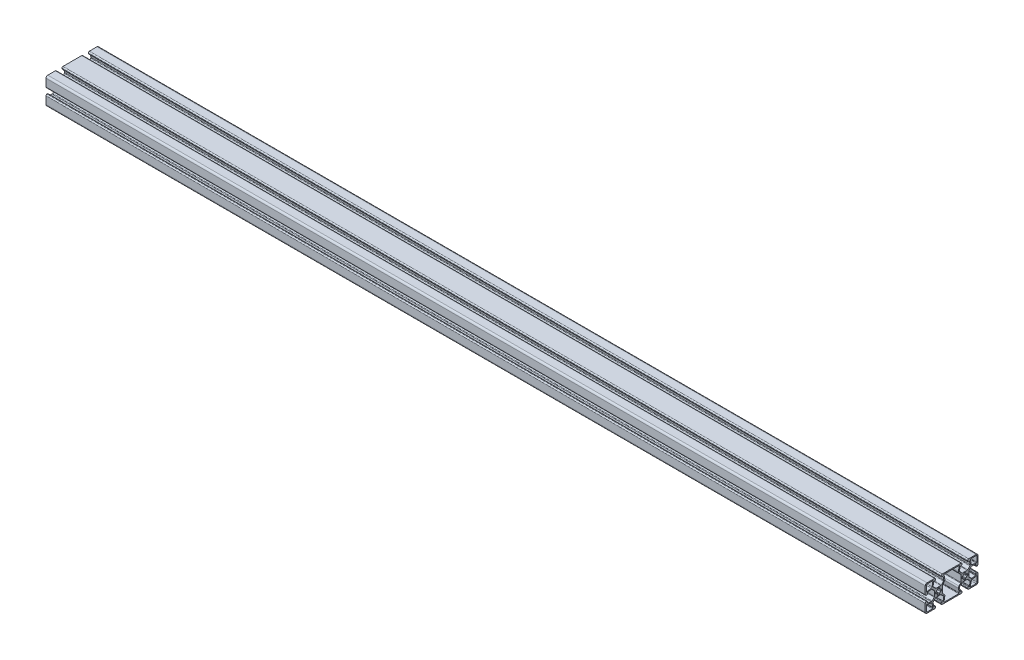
from build123d import *

# Parameters (mm, degrees)
EXTRUDE_1_DEPTH = 1000


with BuildPart() as part:
    # Sketch 1 → Extrude 1 (new body)
    with BuildSketch(Plane(origin=(0, 0, 0), x_dir=(0, 0, -1), z_dir=(1, 0, 0))):
        with BuildLine():
            Line((2.671572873, 4.500000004), (-2.671572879, 4.500000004))
            ThreePointArc((-2.671572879, 4.500000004), (-3.054256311, 4.576120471), (-3.37867966, 4.792893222))
            Line((-3.37867966, 4.792893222), (-5.794402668, 7.208616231))
            ThreePointArc((-5.794402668, 7.208616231), (-6.041012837, 7.615017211), (-6.072103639, 8.089371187))
            Line((-6.072103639, 8.089371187), (-5.367244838, 12.086824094))
            ThreePointArc((-5.367244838, 12.086824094), (-5.196234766, 12.383022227), (-4.874840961, 12.500000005))
            Line((-4.874840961, 12.500000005), (-3.9, 12.500000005))
            ThreePointArc((-3.9, 12.500000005), (-3.369669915, 12.719669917), (-3.15, 13.25))
            Line((-3.15, 13.25), (-3.15, 13.8))
            ThreePointArc((-3.15, 13.8), (-3.501471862, 14.648528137), (-4.35, 15))
            Line((-4.35, 15), (-12.999999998, 15))
            ThreePointArc((-12.999999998, 15), (-14.414213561, 14.414213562), (-14.999999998, 13))
            Line((-14.999999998, 13), (-14.999999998, 4.35))
            ThreePointArc((-14.999999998, 4.35), (-14.648528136, 3.501471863), (-13.799999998, 3.15))
            Line((-13.799999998, 3.15), (-13.250025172, 3.15))
            ThreePointArc((-13.250025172, 3.15), (-12.719678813, 3.369661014), (-12.499999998, 3.9))
            Line((-12.499999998, 3.9), (-12.499999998, 4.874840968))
            ThreePointArc((-12.499999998, 4.874840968), (-12.38302222, 5.196234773), (-12.086824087, 5.367244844))
            Line((-12.086824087, 5.367244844), (-8.089371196, 6.072103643))
            ThreePointArc((-8.089371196, 6.072103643), (-7.615017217, 6.041012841), (-7.208616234, 5.79440267))
            Line((-7.208616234, 5.79440267), (-4.792893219, 3.378679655))
            ThreePointArc((-4.792893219, 3.378679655), (-4.576120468, 3.054256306), (-4.5, 2.671572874))
            Line((-4.5, 2.671572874), (-4.5, -2.671572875))
            ThreePointArc((-4.5, -2.671572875), (-4.576120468, -3.054256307), (-4.792893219, -3.378679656))
            Line((-4.792893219, -3.378679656), (-7.208616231, -5.794402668))
            ThreePointArc((-7.208616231, -5.794402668), (-7.615017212, -6.041012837), (-8.089371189, -6.072103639))
            Line((-8.089371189, -6.072103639), (-12.086824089, -5.367244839))
            ThreePointArc((-12.086824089, -5.367244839), (-12.383022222, -5.196234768), (-12.5, -4.874840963))
            Line((-12.5, -4.874840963), (-12.5, -3.9))
            ThreePointArc((-12.5, -3.9), (-12.719669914, -3.369669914), (-13.25, -3.15))
            Line((-13.25, -3.15), (-13.8, -3.15))
            ThreePointArc((-13.8, -3.15), (-14.648528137, -3.501471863), (-15, -4.35))
            Line((-15, -4.35), (-15, -13))
            ThreePointArc((-15, -13), (-14.414213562, -14.414213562), (-13, -15))
            Line((-13, -15), (-4.349999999, -15))
            ThreePointArc((-4.349999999, -15), (-3.501471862, -14.648528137), (-3.149999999, -13.8))
            Line((-3.149999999, -13.8), (-3.149999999, -13.25))
            ThreePointArc((-3.149999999, -13.25), (-3.369669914, -12.719669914), (-3.9, -12.5))
            Line((-3.9, -12.5), (-4.874840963, -12.5))
            ThreePointArc((-4.874840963, -12.5), (-5.196234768, -12.383022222), (-5.367244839, -12.086824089))
            Line((-5.367244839, -12.086824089), (-6.07210364, -8.089371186))
            ThreePointArc((-6.07210364, -8.089371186), (-6.041012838, -7.615017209), (-5.794402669, -7.208616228))
            Line((-5.794402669, -7.208616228), (-3.378679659, -4.792893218))
            ThreePointArc((-3.378679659, -4.792893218), (-3.05425631, -4.576120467), (-2.671572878, -4.499999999))
            Line((-2.671572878, -4.499999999), (2.671572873, -4.499999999))
            ThreePointArc((2.671572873, -4.499999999), (3.054256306, -4.576120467), (3.378679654, -4.792893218))
            Line((3.378679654, -4.792893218), (5.794402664, -7.208616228))
            ThreePointArc((5.794402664, -7.208616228), (6.041012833, -7.615017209), (6.072103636, -8.089371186))
            Line((6.072103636, -8.089371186), (5.367244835, -12.086824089))
            ThreePointArc((5.367244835, -12.086824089), (5.196234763, -12.383022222), (4.874840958, -12.5))
            Line((4.874840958, -12.5), (3.9, -12.5))
            ThreePointArc((3.9, -12.5), (3.369669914, -12.719669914), (3.15, -13.25))
            Line((3.15, -13.25), (3.15, -13.8))
            ThreePointArc((3.15, -13.8), (3.501471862, -14.648528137), (4.35, -15))
            Line((4.35, -15), (25.65, -15))
            ThreePointArc((25.65, -15), (26.498528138, -14.648528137), (26.85, -13.8))
            Line((26.85, -13.8), (26.85, -13.25))
            ThreePointArc((26.85, -13.25), (26.630330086, -12.719669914), (26.1, -12.5))
            Line((26.1, -12.5), (25.125159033, -12.5))
            ThreePointArc((25.125159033, -12.5), (24.803765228, -12.383022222), (24.632755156, -12.086824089))
            Line((24.632755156, -12.086824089), (23.927896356, -8.089371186))
            ThreePointArc((23.927896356, -8.089371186), (23.958987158, -7.615017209), (24.205597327, -7.208616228))
            Line((24.205597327, -7.208616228), (26.621320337, -4.792893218))
            ThreePointArc((26.621320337, -4.792893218), (26.945743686, -4.576120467), (27.328427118, -4.499999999))
            Line((27.328427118, -4.499999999), (32.671572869, -4.499999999))
            ThreePointArc((32.671572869, -4.499999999), (33.054256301, -4.576120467), (33.37867965, -4.792893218))
            Line((33.37867965, -4.792893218), (35.79440266, -7.208616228))
            ThreePointArc((35.79440266, -7.208616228), (36.041012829, -7.615017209), (36.072103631, -8.089371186))
            Line((36.072103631, -8.089371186), (35.36724483, -12.086824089))
            ThreePointArc((35.36724483, -12.086824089), (35.196234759, -12.383022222), (34.874840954, -12.5))
            Line((34.874840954, -12.5), (33.9, -12.5))
            ThreePointArc((33.9, -12.5), (33.369669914, -12.719669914), (33.15, -13.25))
            Line((33.15, -13.25), (33.15, -13.8))
            ThreePointArc((33.15, -13.8), (33.501471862, -14.648528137), (34.35, -15))
            Line((34.35, -15), (42.999999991, -15))
            ThreePointArc((42.999999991, -15), (44.414213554, -14.414213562), (44.999999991, -13))
            Line((44.999999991, -13), (44.999999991, -4.35))
            ThreePointArc((44.999999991, -4.35), (44.648528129, -3.501471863), (43.799999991, -3.15))
            Line((43.799999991, -3.15), (43.250025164, -3.15))
            ThreePointArc((43.250025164, -3.15), (42.719678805, -3.369661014), (42.499999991, -3.9))
            Line((42.499999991, -3.9), (42.499999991, -4.874840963))
            ThreePointArc((42.499999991, -4.874840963), (42.383022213, -5.196234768), (42.08682408, -5.367244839))
            Line((42.08682408, -5.367244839), (38.089371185, -6.072103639))
            ThreePointArc((38.089371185, -6.072103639), (37.615017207, -6.041012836), (37.208616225, -5.794402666))
            Line((37.208616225, -5.794402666), (34.792893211, -3.378679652))
            ThreePointArc((34.792893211, -3.378679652), (34.57612046, -3.054256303), (34.499999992, -2.671572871))
            Line((34.499999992, -2.671572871), (34.499999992, 2.671572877))
            ThreePointArc((34.499999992, 2.671572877), (34.57612046, 3.05425631), (34.792893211, 3.378679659))
            Line((34.792893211, 3.378679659), (37.208616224, 5.794402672))
            ThreePointArc((37.208616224, 5.794402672), (37.615017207, 6.041012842), (38.089371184, 6.072103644))
            Line((38.089371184, 6.072103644), (42.08682408, 5.367244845))
            ThreePointArc((42.08682408, 5.367244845), (42.383022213, 5.196234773), (42.499999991, 4.874840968))
            Line((42.499999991, 4.874840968), (42.499999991, 3.9))
            ThreePointArc((42.499999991, 3.9), (42.719669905, 3.369669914), (43.249999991, 3.15))
            Line((43.249999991, 3.15), (43.799999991, 3.15))
            ThreePointArc((43.799999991, 3.15), (44.648528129, 3.501471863), (44.999999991, 4.350000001))
            Line((44.999999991, 4.350000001), (44.999999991, 13.000000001))
            ThreePointArc((44.999999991, 13.000000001), (44.414213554, 14.414213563), (42.999999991, 15.000000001))
            Line((42.999999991, 15.000000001), (34.35, 15.000000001))
            ThreePointArc((34.35, 15.000000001), (33.501471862, 14.648528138), (33.15, 13.800000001))
            Line((33.15, 13.800000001), (33.15, 13.250000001))
            ThreePointArc((33.15, 13.250000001), (33.369669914, 12.719669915), (33.9, 12.500000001))
            Line((33.9, 12.500000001), (34.874840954, 12.500000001))
            ThreePointArc((34.874840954, 12.500000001), (35.196234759, 12.383022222), (35.367244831, 12.08682409))
            Line((35.367244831, 12.08682409), (36.072103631, 8.089371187))
            ThreePointArc((36.072103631, 8.089371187), (36.041012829, 7.61501721), (35.79440266, 7.208616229))
            Line((35.79440266, 7.208616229), (33.37867965, 4.792893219))
            ThreePointArc((33.37867965, 4.792893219), (33.054256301, 4.576120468), (32.671572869, 4.5))
            Line((32.671572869, 4.5), (27.328427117, 4.5))
            ThreePointArc((27.328427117, 4.5), (26.945743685, 4.576120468), (26.621320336, 4.792893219))
            Line((26.621320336, 4.792893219), (24.205597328, 7.208616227))
            ThreePointArc((24.205597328, 7.208616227), (23.958987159, 7.615017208), (23.927896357, 8.089371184))
            Line((23.927896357, 8.089371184), (24.632755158, 12.08682409))
            ThreePointArc((24.632755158, 12.08682409), (24.803765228, 12.383022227), (25.125159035, 12.500000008))
            Line((25.125159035, 12.500000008), (26.1, 12.500000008))
            ThreePointArc((26.1, 12.500000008), (26.630330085, 12.71966992), (26.85, 13.250000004))
            Line((26.85, 13.250000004), (26.85, 13.800000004))
            ThreePointArc((26.85, 13.800000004), (26.498528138, 14.648528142), (25.65, 15.000000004))
            Line((25.65, 15.000000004), (4.35, 15.000000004))
            ThreePointArc((4.35, 15.000000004), (3.501471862, 14.648528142), (3.15, 13.800000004))
            Line((3.15, 13.800000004), (3.15, 13.250000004))
            ThreePointArc((3.15, 13.250000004), (3.369669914, 12.719669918), (3.9, 12.500000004))
            Line((3.9, 12.500000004), (4.874840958, 12.500000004))
            ThreePointArc((4.874840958, 12.500000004), (5.196234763, 12.383022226), (5.367244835, 12.086824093))
            Line((5.367244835, 12.086824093), (6.072103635, 8.08937119))
            ThreePointArc((6.072103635, 8.08937119), (6.041012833, 7.615017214), (5.794402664, 7.208616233))
            Line((5.794402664, 7.208616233), (3.378679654, 4.792893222))
            ThreePointArc((3.378679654, 4.792893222), (3.054256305, 4.576120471), (2.671572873, 4.500000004))
        make_face()
        with BuildLine():
            Line((-13.8, -12.8), (-13.8, -6.649664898))
            ThreePointArc((-13.8, -6.649664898), (-13.526133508, -6.203723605), (-13.004545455, -6.246295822))
            ThreePointArc((-13.004545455, -6.246295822), (-12.667267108, -6.43841207), (-12.295201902, -6.549014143))
            Line((-12.295201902, -6.549014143), (-8.099915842, -7.288756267))
            ThreePointArc((-8.099915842, -7.288756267), (-7.566457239, -7.566457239), (-7.288756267, -8.099915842))
            Line((-7.288756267, -8.099915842), (-6.549014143, -12.295201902))
            ThreePointArc((-6.549014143, -12.295201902), (-6.43841207, -12.667267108), (-6.246295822, -13.004545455))
            ThreePointArc((-6.246295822, -13.004545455), (-6.203723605, -13.526133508), (-6.649664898, -13.8))
            Line((-6.649664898, -13.8), (-12.8, -13.8))
            ThreePointArc((-12.8, -13.8), (-13.507106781, -13.507106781), (-13.8, -12.8))
        make_face(mode=Mode.SUBTRACT)
        with BuildLine():
            Line((-7.288756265, 8.099915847), (-6.549014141, 12.295201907))
            ThreePointArc((-6.549014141, 12.295201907), (-6.438412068, 12.667267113), (-6.24629582, 13.00454546))
            ThreePointArc((-6.24629582, 13.00454546), (-6.203723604, 13.526133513), (-6.649664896, 13.800000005))
            Line((-6.649664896, 13.800000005), (-12.799999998, 13.800000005))
            ThreePointArc((-12.799999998, 13.800000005), (-13.50710678, 13.507106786), (-13.799999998, 12.800000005))
            Line((-13.799999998, 12.800000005), (-13.799999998, 6.649664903))
            ThreePointArc((-13.799999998, 6.649664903), (-13.526133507, 6.20372361), (-13.004545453, 6.246295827))
            ThreePointArc((-13.004545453, 6.246295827), (-12.667267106, 6.438412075), (-12.2952019, 6.549014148))
            Line((-12.2952019, 6.549014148), (-8.099915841, 7.288756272))
            ThreePointArc((-8.099915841, 7.288756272), (-7.566457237, 7.566457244), (-7.288756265, 8.099915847))
        make_face(mode=Mode.SUBTRACT)
        with BuildLine():
            Line((-3.5, -0.5), (-3.5, 0.5))
            ThreePointArc((-3.5, 0.5), (-3.353553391, 0.853553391), (-3, 1))
            Line((-3, 1), (-2.655654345, 1))
            ThreePointArc((-2.655654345, 1), (-2.403613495, 1.068172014), (-2.220301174, 1.254098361))
            ThreePointArc((-2.220301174, 1.254098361), (-1.803122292, 1.803122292), (-1.254098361, 2.220301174))
            ThreePointArc((-1.254098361, 2.220301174), (-1.068172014, 2.403613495), (-1, 2.655654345))
            Line((-1, 2.655654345), (-1, 3))
            ThreePointArc((-1, 3), (-0.853553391, 3.353553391), (-0.5, 3.5))
            Line((-0.5, 3.5), (0.5, 3.5))
            ThreePointArc((0.5, 3.5), (0.853553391, 3.353553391), (1, 3))
            Line((1, 3), (1, 2.655654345))
            ThreePointArc((1, 2.655654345), (1.068172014, 2.403613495), (1.254098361, 2.220301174))
            ThreePointArc((1.254098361, 2.220301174), (1.803122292, 1.803122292), (2.220301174, 1.254098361))
            ThreePointArc((2.220301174, 1.254098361), (2.403613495, 1.068172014), (2.655654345, 1))
            Line((2.655654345, 1), (3, 1))
            ThreePointArc((3, 1), (3.353553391, 0.853553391), (3.5, 0.5))
            Line((3.5, 0.5), (3.5, -0.5))
            ThreePointArc((3.5, -0.5), (3.353553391, -0.853553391), (3, -1))
            Line((3, -1), (2.655654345, -1))
            ThreePointArc((2.655654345, -1), (2.403613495, -1.068172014), (2.220301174, -1.254098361))
            ThreePointArc((2.220301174, -1.254098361), (1.803122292, -1.803122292), (1.254098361, -2.220301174))
            ThreePointArc((1.254098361, -2.220301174), (1.068172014, -2.403613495), (1, -2.655654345))
            Line((1, -2.655654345), (1, -3))
            ThreePointArc((1, -3), (0.853553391, -3.353553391), (0.5, -3.5))
            Line((0.5, -3.5), (-0.5, -3.5))
            ThreePointArc((-0.5, -3.5), (-0.853553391, -3.353553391), (-1, -3))
            Line((-1, -3), (-1, -2.655654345))
            ThreePointArc((-1, -2.655654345), (-1.068172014, -2.403613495), (-1.254098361, -2.220301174))
            ThreePointArc((-1.254098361, -2.220301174), (-1.803122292, -1.803122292), (-2.220301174, -1.254098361))
            ThreePointArc((-2.220301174, -1.254098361), (-2.403613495, -1.068172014), (-2.655654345, -1))
            Line((-2.655654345, -1), (-3, -1))
            ThreePointArc((-3, -1), (-3.353553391, -0.853553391), (-3.5, -0.5))
        make_face(mode=Mode.SUBTRACT)
        with BuildLine():
            Line((37.288756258, -8.099915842), (36.549014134, -12.295201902))
            ThreePointArc((36.549014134, -12.295201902), (36.438412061, -12.667267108), (36.246295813, -13.004545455))
            ThreePointArc((36.246295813, -13.004545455), (36.203723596, -13.526133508), (36.649664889, -13.8))
            Line((36.649664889, -13.8), (42.799999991, -13.8))
            ThreePointArc((42.799999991, -13.8), (43.507106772, -13.507106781), (43.799999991, -12.8))
            Line((43.799999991, -12.8), (43.799999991, -6.649664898))
            ThreePointArc((43.799999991, -6.649664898), (43.5261335, -6.203723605), (43.004545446, -6.246295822))
            ThreePointArc((43.004545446, -6.246295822), (42.667267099, -6.43841207), (42.295201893, -6.549014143))
            Line((42.295201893, -6.549014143), (38.099915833, -7.288756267))
            ThreePointArc((38.099915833, -7.288756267), (37.56645723, -7.566457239), (37.288756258, -8.099915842))
        make_face(mode=Mode.SUBTRACT)
        with BuildLine():
            Line((22.746127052, -8.297748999), (23.612849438, -13.213175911))
            ThreePointArc((23.612849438, -13.213175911), (23.503467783, -13.621393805), (23.120445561, -13.8))
            Line((23.120445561, -13.8), (6.649664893, -13.8))
            ThreePointArc((6.649664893, -13.8), (6.203723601, -13.526133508), (6.246295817, -13.004545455))
            ThreePointArc((6.246295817, -13.004545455), (6.438412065, -12.667267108), (6.549014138, -12.295201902))
            Line((6.549014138, -12.295201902), (7.253872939, -8.297748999))
            ThreePointArc((7.253872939, -8.297748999), (7.185473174, -7.25417025), (6.642930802, -6.360088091))
            Line((6.642930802, -6.360088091), (4.792893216, -4.510050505))
            ThreePointArc((4.792893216, -4.510050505), (4.576120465, -4.185627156), (4.499999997, -3.802943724))
            Line((4.499999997, -3.802943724), (4.499999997, 3.802943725))
            ThreePointArc((4.499999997, 3.802943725), (4.576120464, 4.185627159), (4.792893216, 4.510050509))
            Line((4.792893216, 4.510050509), (6.642930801, 6.360088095))
            ThreePointArc((6.642930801, 6.360088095), (7.185473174, 7.254170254), (7.253872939, 8.297749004))
            Line((7.253872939, 8.297749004), (6.549014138, 12.295201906))
            ThreePointArc((6.549014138, 12.295201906), (6.438412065, 12.667267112), (6.246295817, 13.004545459))
            ThreePointArc((6.246295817, 13.004545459), (6.2037236, 13.526133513), (6.649664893, 13.800000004))
            Line((6.649664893, 13.800000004), (23.350335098, 13.800000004))
            ThreePointArc((23.350335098, 13.800000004), (23.79627639, 13.526133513), (23.753704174, 13.004545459))
            ThreePointArc((23.753704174, 13.004545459), (23.561587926, 12.667267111), (23.450985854, 12.295201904))
            Line((23.450985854, 12.295201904), (22.746127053, 8.297748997))
            ThreePointArc((22.746127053, 8.297748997), (22.814526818, 7.254170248), (23.35706919, 6.360088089))
            Line((23.35706919, 6.360088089), (25.207106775, 4.510050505))
            ThreePointArc((25.207106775, 4.510050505), (25.423879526, 4.185627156), (25.499999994, 3.802943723))
            Line((25.499999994, 3.802943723), (25.499999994, -3.802943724))
            ThreePointArc((25.499999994, -3.802943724), (25.423879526, -4.185627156), (25.207106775, -4.510050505))
            Line((25.207106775, -4.510050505), (23.357069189, -6.36008809))
            ThreePointArc((23.357069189, -6.36008809), (22.814526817, -7.25417025), (22.746127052, -8.297748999))
        make_face(mode=Mode.SUBTRACT)
        with BuildLine():
            Line((26.5, -0.5), (26.5, 0.5))
            ThreePointArc((26.5, 0.5), (26.646446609, 0.853553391), (27, 1))
            Line((27, 1), (27.344345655, 1))
            ThreePointArc((27.344345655, 1), (27.596386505, 1.068172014), (27.779698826, 1.254098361))
            ThreePointArc((27.779698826, 1.254098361), (28.196877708, 1.803122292), (28.745901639, 2.220301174))
            ThreePointArc((28.745901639, 2.220301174), (28.931827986, 2.403613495), (29, 2.655654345))
            Line((29, 2.655654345), (29, 3))
            ThreePointArc((29, 3), (29.146446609, 3.353553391), (29.5, 3.5))
            Line((29.5, 3.5), (30.5, 3.5))
            ThreePointArc((30.5, 3.5), (30.853553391, 3.353553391), (31, 3))
            Line((31, 3), (31, 2.655654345))
            ThreePointArc((31, 2.655654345), (31.068172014, 2.403613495), (31.254098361, 2.220301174))
            ThreePointArc((31.254098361, 2.220301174), (31.803122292, 1.803122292), (32.220301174, 1.254098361))
            ThreePointArc((32.220301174, 1.254098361), (32.403613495, 1.068172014), (32.655654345, 1))
            Line((32.655654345, 1), (33, 1))
            ThreePointArc((33, 1), (33.353553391, 0.853553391), (33.5, 0.5))
            Line((33.5, 0.5), (33.5, -0.5))
            ThreePointArc((33.5, -0.5), (33.353553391, -0.853553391), (33, -1))
            Line((33, -1), (32.655654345, -1))
            ThreePointArc((32.655654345, -1), (32.403613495, -1.068172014), (32.220301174, -1.254098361))
            ThreePointArc((32.220301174, -1.254098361), (31.803122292, -1.803122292), (31.254098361, -2.220301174))
            ThreePointArc((31.254098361, -2.220301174), (31.068172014, -2.403613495), (31, -2.655654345))
            Line((31, -2.655654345), (31, -3))
            ThreePointArc((31, -3), (30.853553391, -3.353553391), (30.5, -3.5))
            Line((30.5, -3.5), (29.5, -3.5))
            ThreePointArc((29.5, -3.5), (29.146446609, -3.353553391), (29, -3))
            Line((29, -3), (29, -2.655654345))
            ThreePointArc((29, -2.655654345), (28.931827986, -2.403613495), (28.745901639, -2.220301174))
            ThreePointArc((28.745901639, -2.220301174), (28.196877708, -1.803122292), (27.779698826, -1.254098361))
            ThreePointArc((27.779698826, -1.254098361), (27.596386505, -1.068172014), (27.344345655, -1))
            Line((27.344345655, -1), (27, -1))
            ThreePointArc((27, -1), (26.646446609, -0.853553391), (26.5, -0.5))
        make_face(mode=Mode.SUBTRACT)
        with BuildLine():
            Line((43.8, 12.8), (43.8, 6.879554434))
            ThreePointArc((43.8, 6.879554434), (43.621393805, 6.496532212), (43.213175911, 6.387150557))
            Line((43.213175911, 6.387150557), (38.099915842, 7.288756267))
            ThreePointArc((38.099915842, 7.288756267), (37.566457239, 7.566457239), (37.288756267, 8.099915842))
            Line((37.288756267, 8.099915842), (36.387150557, 13.213175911))
            ThreePointArc((36.387150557, 13.213175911), (36.496532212, 13.621393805), (36.879554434, 13.8))
            Line((36.879554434, 13.8), (42.8, 13.8))
            ThreePointArc((42.8, 13.8), (43.507106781, 13.507106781), (43.8, 12.8))
        make_face(mode=Mode.SUBTRACT)
    extrude(amount=EXTRUDE_1_DEPTH)


solid = part.part
